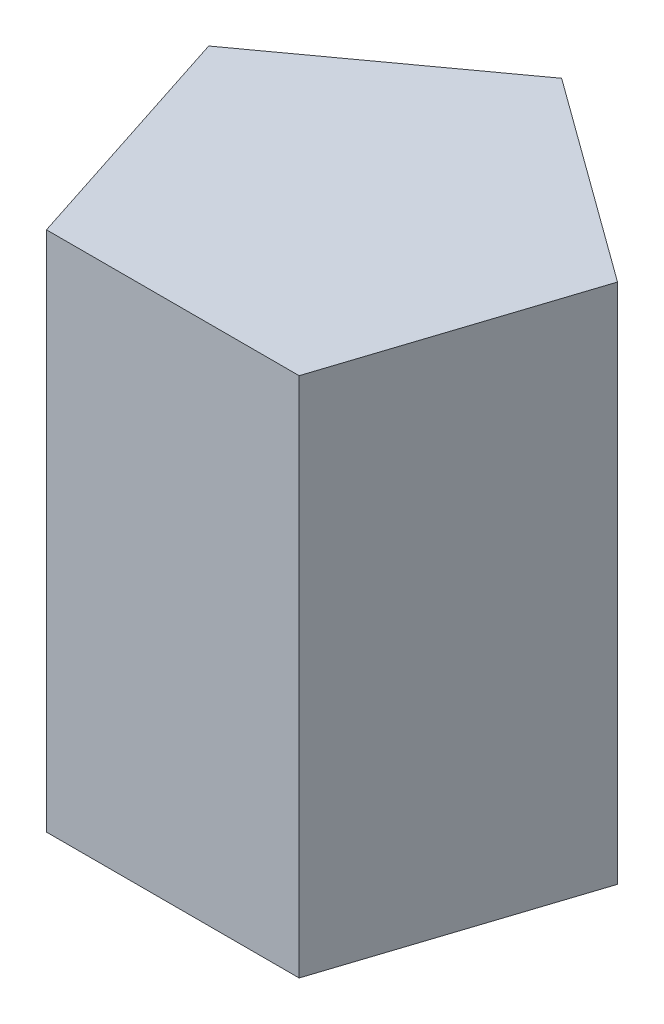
ISO-10303-21;
HEADER;
FILE_DESCRIPTION(('STEP AP214'),'2;1');
FILE_NAME('part.step','',(''),(''),'','','');
FILE_SCHEMA(('AUTOMOTIVE_DESIGN { 1 0 10303 214 1 1 1 1 }'));
ENDSEC;
DATA;
#1=APPLICATION_CONTEXT('core data for automotive mechanical design processes');
#2=APPLICATION_PROTOCOL_DEFINITION('international standard','automotive_design',2000,#1);
#3=PRODUCT_CONTEXT('',#1,'mechanical');
#4=PRODUCT('Part','Part','',(#3));
#5=PRODUCT_RELATED_PRODUCT_CATEGORY('part','',(#4));
#6=PRODUCT_DEFINITION_FORMATION('','',#4);
#7=PRODUCT_DEFINITION_CONTEXT('part definition',#1,'design');
#8=PRODUCT_DEFINITION('design','',#6,#7);
#9=PRODUCT_DEFINITION_SHAPE('','',#8);
#10=(LENGTH_UNIT() NAMED_UNIT(*) SI_UNIT(.MILLI.,.METRE.));
#11=(NAMED_UNIT(*) PLANE_ANGLE_UNIT() SI_UNIT($,.RADIAN.));
#12=(NAMED_UNIT(*) SI_UNIT($,.STERADIAN.) SOLID_ANGLE_UNIT());
#13=UNCERTAINTY_MEASURE_WITH_UNIT(LENGTH_MEASURE(1.E-05),#10,'distance_accuracy_value','');
#14=(GEOMETRIC_REPRESENTATION_CONTEXT(3) GLOBAL_UNCERTAINTY_ASSIGNED_CONTEXT((#13)) GLOBAL_UNIT_ASSIGNED_CONTEXT((#10,
#11,#12)) REPRESENTATION_CONTEXT('',''));
#15=CARTESIAN_POINT('',(0.,0.,0.));
#16=DIRECTION('',(0.,0.,1.));
#17=DIRECTION('',(1.,0.,0.));
#18=AXIS2_PLACEMENT_3D('',#15,#16,#17);
#19=CARTESIAN_POINT('',(23.5114100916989,60.,-7.63932022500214));
#20=DIRECTION('',(-0.587785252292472,0.,0.809016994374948));
#21=DIRECTION('',(0.809016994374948,0.,0.587785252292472));
#22=AXIS2_PLACEMENT_3D('',#19,#20,#21);
#23=PLANE('',#22);
#24=DIRECTION('',(-0.809016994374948,0.,-0.587785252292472));
#25=VECTOR('',#24,1.);
#26=CARTESIAN_POINT('',(23.5114100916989,0.,-7.63932022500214));
#27=LINE('',#26,#25);
#28=CARTESIAN_POINT('',(23.5114100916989,0.,-7.63932022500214));
#29=VERTEX_POINT('',#28);
#30=CARTESIAN_POINT('',(0.,0.,-24.7213595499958));
#31=VERTEX_POINT('',#30);
#32=EDGE_CURVE('E105',#29,#31,#27,.T.);
#33=ORIENTED_EDGE('',*,*,#32,.T.);
#34=DIRECTION('',(0.,-1.,0.));
#35=VECTOR('',#34,1.);
#36=CARTESIAN_POINT('',(0.,60.,-24.7213595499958));
#37=LINE('',#36,#35);
#38=CARTESIAN_POINT('',(0.,60.,-24.7213595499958));
#39=VERTEX_POINT('',#38);
#40=EDGE_CURVE('E11',#39,#31,#37,.T.);
#41=ORIENTED_EDGE('',*,*,#40,.F.);
#42=DIRECTION('',(-0.809016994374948,0.,-0.587785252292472));
#43=VECTOR('',#42,1.);
#44=CARTESIAN_POINT('',(23.5114100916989,60.,-7.63932022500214));
#45=LINE('',#44,#43);
#46=CARTESIAN_POINT('',(23.5114100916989,60.,-7.63932022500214));
#47=VERTEX_POINT('',#46);
#48=EDGE_CURVE('E113',#47,#39,#45,.T.);
#49=ORIENTED_EDGE('',*,*,#48,.F.);
#50=DIRECTION('',(0.,-1.,0.));
#51=VECTOR('',#50,1.);
#52=CARTESIAN_POINT('',(23.5114100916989,60.,-7.63932022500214));
#53=LINE('',#52,#51);
#54=EDGE_CURVE('E101',#47,#29,#53,.T.);
#55=ORIENTED_EDGE('',*,*,#54,.T.);
#56=EDGE_LOOP('',(#33,#41,#49,#55));
#57=FACE_BOUND('',#56,.T.);
#58=ADVANCED_FACE('F31',(#57),#23,.F.);
#59=CARTESIAN_POINT('',(0.,60.,-24.7213595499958));
#60=DIRECTION('',(0.587785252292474,0.,0.809016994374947));
#61=DIRECTION('',(0.809016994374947,0.,-0.587785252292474));
#62=AXIS2_PLACEMENT_3D('',#59,#60,#61);
#63=PLANE('',#62);
#64=DIRECTION('',(-0.809016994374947,0.,0.587785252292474));
#65=VECTOR('',#64,1.);
#66=CARTESIAN_POINT('',(0.,0.,-24.7213595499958));
#67=LINE('',#66,#65);
#68=CARTESIAN_POINT('',(-23.5114100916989,0.,-7.63932022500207));
#69=VERTEX_POINT('',#68);
#70=EDGE_CURVE('E108',#31,#69,#67,.T.);
#71=ORIENTED_EDGE('',*,*,#70,.T.);
#72=DIRECTION('',(0.,-1.,0.));
#73=VECTOR('',#72,1.);
#74=CARTESIAN_POINT('',(-23.5114100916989,60.,-7.63932022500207));
#75=LINE('',#74,#73);
#76=CARTESIAN_POINT('',(-23.5114100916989,60.,-7.63932022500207));
#77=VERTEX_POINT('',#76);
#78=EDGE_CURVE('E39',#77,#69,#75,.T.);
#79=ORIENTED_EDGE('',*,*,#78,.F.);
#80=DIRECTION('',(-0.809016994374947,0.,0.587785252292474));
#81=VECTOR('',#80,1.);
#82=CARTESIAN_POINT('',(0.,60.,-24.7213595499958));
#83=LINE('',#82,#81);
#84=EDGE_CURVE('E81',#39,#77,#83,.T.);
#85=ORIENTED_EDGE('',*,*,#84,.F.);
#86=ORIENTED_EDGE('',*,*,#40,.T.);
#87=EDGE_LOOP('',(#71,#79,#85,#86));
#88=FACE_BOUND('',#87,.T.);
#89=ADVANCED_FACE('F132',(#88),#63,.F.);
#90=CARTESIAN_POINT('',(-23.5114100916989,60.,-7.63932022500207));
#91=DIRECTION('',(0.951056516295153,0.,-0.309016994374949));
#92=DIRECTION('',(-0.309016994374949,0.,-0.951056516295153));
#93=AXIS2_PLACEMENT_3D('',#90,#91,#92);
#94=PLANE('',#93);
#95=DIRECTION('',(0.309016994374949,0.,0.951056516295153));
#96=VECTOR('',#95,1.);
#97=CARTESIAN_POINT('',(-23.5114100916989,0.,-7.63932022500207));
#98=LINE('',#97,#96);
#99=CARTESIAN_POINT('',(-14.5308505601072,0.,20.));
#100=VERTEX_POINT('',#99);
#101=EDGE_CURVE('E96',#69,#100,#98,.T.);
#102=ORIENTED_EDGE('',*,*,#101,.T.);
#103=DIRECTION('',(0.,-1.,0.));
#104=VECTOR('',#103,1.);
#105=CARTESIAN_POINT('',(-14.5308505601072,60.,20.));
#106=LINE('',#105,#104);
#107=CARTESIAN_POINT('',(-14.5308505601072,60.,20.));
#108=VERTEX_POINT('',#107);
#109=EDGE_CURVE('E93',#108,#100,#106,.T.);
#110=ORIENTED_EDGE('',*,*,#109,.F.);
#111=DIRECTION('',(0.309016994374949,0.,0.951056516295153));
#112=VECTOR('',#111,1.);
#113=CARTESIAN_POINT('',(-23.5114100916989,60.,-7.63932022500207));
#114=LINE('',#113,#112);
#115=EDGE_CURVE('E85',#77,#108,#114,.T.);
#116=ORIENTED_EDGE('',*,*,#115,.F.);
#117=ORIENTED_EDGE('',*,*,#78,.T.);
#118=EDGE_LOOP('',(#102,#110,#116,#117));
#119=FACE_BOUND('',#118,.T.);
#120=ADVANCED_FACE('F94',(#119),#94,.F.);
#121=CARTESIAN_POINT('',(-14.5308505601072,60.,20.));
#122=DIRECTION('',(0.,0.,-1.));
#123=DIRECTION('',(-1.,0.,0.));
#124=AXIS2_PLACEMENT_3D('',#121,#122,#123);
#125=PLANE('',#124);
#126=DIRECTION('',(1.,0.,0.));
#127=VECTOR('',#126,1.);
#128=CARTESIAN_POINT('',(-14.5308505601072,0.,20.));
#129=LINE('',#128,#127);
#130=CARTESIAN_POINT('',(14.5308505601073,0.,20.));
#131=VERTEX_POINT('',#130);
#132=EDGE_CURVE('E67',#100,#131,#129,.T.);
#133=ORIENTED_EDGE('',*,*,#132,.T.);
#134=DIRECTION('',(0.,-1.,0.));
#135=VECTOR('',#134,1.);
#136=CARTESIAN_POINT('',(14.5308505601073,60.,20.));
#137=LINE('',#136,#135);
#138=CARTESIAN_POINT('',(14.5308505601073,60.,20.));
#139=VERTEX_POINT('',#138);
#140=EDGE_CURVE('E97',#139,#131,#137,.T.);
#141=ORIENTED_EDGE('',*,*,#140,.F.);
#142=DIRECTION('',(1.,0.,0.));
#143=VECTOR('',#142,1.);
#144=CARTESIAN_POINT('',(-14.5308505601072,60.,20.));
#145=LINE('',#144,#143);
#146=EDGE_CURVE('E89',#108,#139,#145,.T.);
#147=ORIENTED_EDGE('',*,*,#146,.F.);
#148=ORIENTED_EDGE('',*,*,#109,.T.);
#149=EDGE_LOOP('',(#133,#141,#147,#148));
#150=FACE_BOUND('',#149,.T.);
#151=ADVANCED_FACE('F99',(#150),#125,.F.);
#152=CARTESIAN_POINT('',(14.5308505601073,60.,20.));
#153=DIRECTION('',(-0.951056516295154,0.,-0.309016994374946));
#154=DIRECTION('',(-0.309016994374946,0.,0.951056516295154));
#155=AXIS2_PLACEMENT_3D('',#152,#153,#154);
#156=PLANE('',#155);
#157=DIRECTION('',(0.309016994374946,0.,-0.951056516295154));
#158=VECTOR('',#157,1.);
#159=CARTESIAN_POINT('',(14.5308505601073,0.,20.));
#160=LINE('',#159,#158);
#161=EDGE_CURVE('E73',#131,#29,#160,.T.);
#162=ORIENTED_EDGE('',*,*,#161,.T.);
#163=ORIENTED_EDGE('',*,*,#54,.F.);
#164=DIRECTION('',(0.309016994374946,0.,-0.951056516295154));
#165=VECTOR('',#164,1.);
#166=CARTESIAN_POINT('',(14.5308505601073,60.,20.));
#167=LINE('',#166,#165);
#168=EDGE_CURVE('E47',#139,#47,#167,.T.);
#169=ORIENTED_EDGE('',*,*,#168,.F.);
#170=ORIENTED_EDGE('',*,*,#140,.T.);
#171=EDGE_LOOP('',(#162,#163,#169,#170));
#172=FACE_BOUND('',#171,.T.);
#173=ADVANCED_FACE('F121',(#172),#156,.F.);
#174=CARTESIAN_POINT('',(0.,60.,-24.7213595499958));
#175=DIRECTION('',(0.,1.,0.));
#176=DIRECTION('',(0.,0.,1.));
#177=AXIS2_PLACEMENT_3D('',#174,#175,#176);
#178=PLANE('',#177);
#179=ORIENTED_EDGE('',*,*,#48,.T.);
#180=ORIENTED_EDGE('',*,*,#84,.T.);
#181=ORIENTED_EDGE('',*,*,#115,.T.);
#182=ORIENTED_EDGE('',*,*,#146,.T.);
#183=ORIENTED_EDGE('',*,*,#168,.T.);
#184=EDGE_LOOP('',(#179,#180,#181,#182,#183));
#185=FACE_BOUND('',#184,.T.);
#186=ADVANCED_FACE('F87',(#185),#178,.T.);
#187=CARTESIAN_POINT('',(0.,0.,-24.7213595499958));
#188=DIRECTION('',(0.,1.,0.));
#189=DIRECTION('',(0.,0.,1.));
#190=AXIS2_PLACEMENT_3D('',#187,#188,#189);
#191=PLANE('',#190);
#192=ORIENTED_EDGE('',*,*,#32,.F.);
#193=ORIENTED_EDGE('',*,*,#161,.F.);
#194=ORIENTED_EDGE('',*,*,#132,.F.);
#195=ORIENTED_EDGE('',*,*,#101,.F.);
#196=ORIENTED_EDGE('',*,*,#70,.F.);
#197=EDGE_LOOP('',(#192,#193,#194,#195,#196));
#198=FACE_BOUND('',#197,.T.);
#199=ADVANCED_FACE('F117',(#198),#191,.F.);
#200=CLOSED_SHELL('',(#58,#89,#120,#151,#173,#186,#199));
#201=MANIFOLD_SOLID_BREP('B2',#200);
#202=ADVANCED_BREP_SHAPE_REPRESENTATION('',(#18,#201),#14);
#203=SHAPE_DEFINITION_REPRESENTATION(#9,#202);
ENDSEC;
END-ISO-10303-21;
